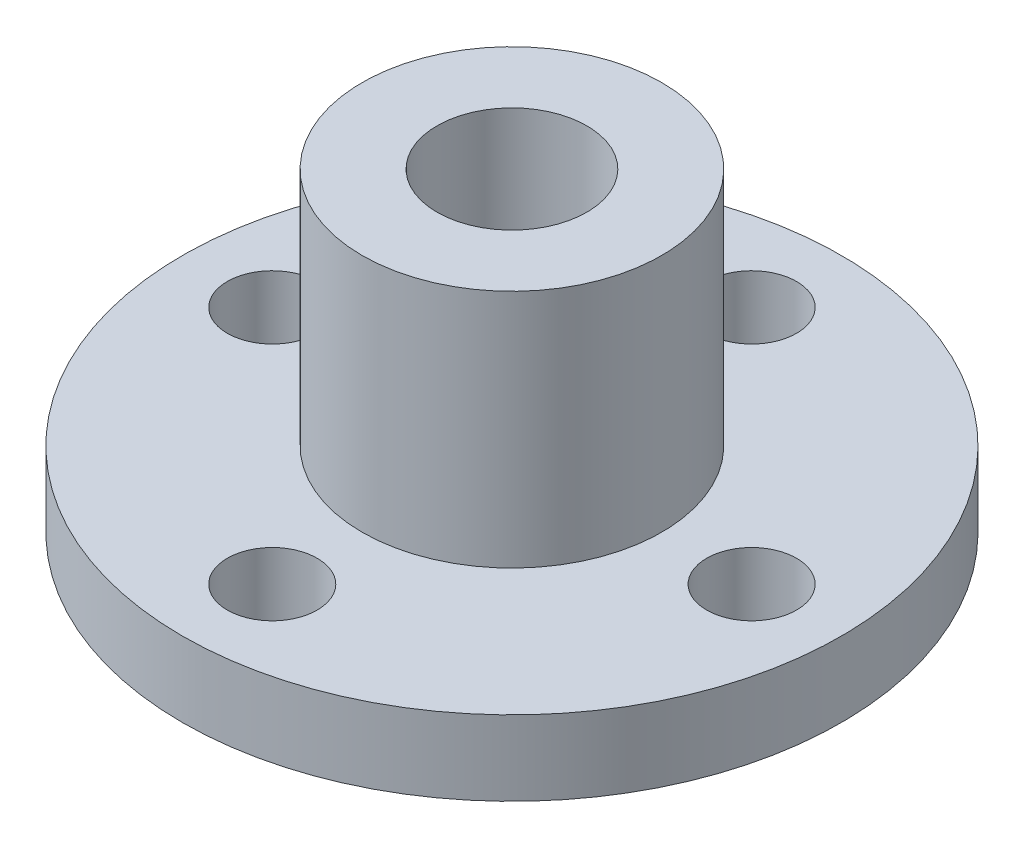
from build123d import *

# Parameters (mm, degrees)
SKETCH_2_R               = 11
EXTRUDE_1_DEPTH          = 2.5
CUT_EXTRUDE_1_DEPTH      = 16.755951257
CUT_EXTRUDE_1_DEPTH_BACK = 16.755951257
SKETCH_3_R               = 1.5
SKETCH_4_R               = 5
EXTRUDE_2_DEPTH          = 8
CUT_EXTRUDE_2_DEPTH      = 19.768324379
CUT_EXTRUDE_2_DEPTH_BACK = 19.768324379
SKETCH_6_R               = 2.5


with BuildPart() as part:
    # Sketch 2 → Extrude 1 (new body)
    with BuildSketch(Plane(origin=(0, 0, 0), x_dir=(1, 0, 0), z_dir=(0, 1, 0))):
        with Locations(Location((0, 0, 0), (0, 0, 270))):
            Circle(SKETCH_2_R)
    extrude(amount=EXTRUDE_1_DEPTH)

    # Sketch 3 → Cut-Extrude 1 (cut, two sides: drawn at the far end of the back side and taken through both)
    with BuildSketch(Plane(origin=(0, 2.5, 0), x_dir=(1, 0, 0), z_dir=(0, 1, 0)).offset(-CUT_EXTRUDE_1_DEPTH_BACK)):
        with Locations(Location((0, 8, 0), (0, 0, 270))):
            Circle(SKETCH_3_R)
        with Locations(Location((8, 0, 0), (0, 0, 270))):
            Circle(SKETCH_3_R)
        with Locations(Location((0, -8, 0), (0, 0, 270))):
            Circle(SKETCH_3_R)
        with Locations(Location((-8, 0, 0), (0, 0, 270))):
            Circle(SKETCH_3_R)
    extrude(amount=CUT_EXTRUDE_1_DEPTH + CUT_EXTRUDE_1_DEPTH_BACK, mode=Mode.SUBTRACT)

    # Sketch 4 → Extrude 2 (add)
    with BuildSketch(Plane(origin=(0, 2.5, 0), x_dir=(1, 0, 0), z_dir=(0, 1, 0))):
        with Locations(Location((0, 0, 0), (0, 0, 270))):
            Circle(SKETCH_4_R)
    extrude(amount=EXTRUDE_2_DEPTH)

    # Sketch 6 → Cut-Extrude 2 (cut, two sides: drawn at the far end of the back side and taken through both)
    with BuildSketch(Plane(origin=(0, 10.5, 0), x_dir=(1, 0, 0), z_dir=(0, 1, 0)).offset(-CUT_EXTRUDE_2_DEPTH_BACK)):
        with Locations(Location((0, 0, 0), (0, 0, 270))):
            Circle(SKETCH_6_R)
    extrude(amount=CUT_EXTRUDE_2_DEPTH + CUT_EXTRUDE_2_DEPTH_BACK, mode=Mode.SUBTRACT)


solid = part.part
